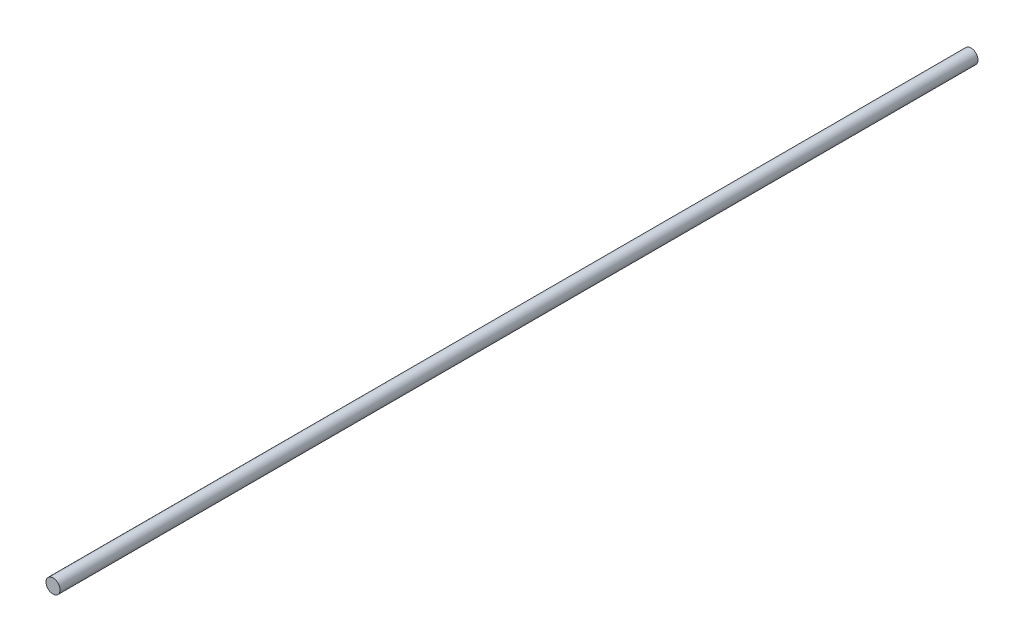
from build123d import *

# Parameters (mm, degrees)
SKETCH1_R           = 1.4
BOSS_EXTRUDE1_DEPTH = 182.88


with BuildPart() as part:
    # Sketch1 → Boss-Extrude1 (new body)
    with BuildSketch(Plane.XY):
        Circle(SKETCH1_R)
    extrude(amount=BOSS_EXTRUDE1_DEPTH)


solid = part.part
